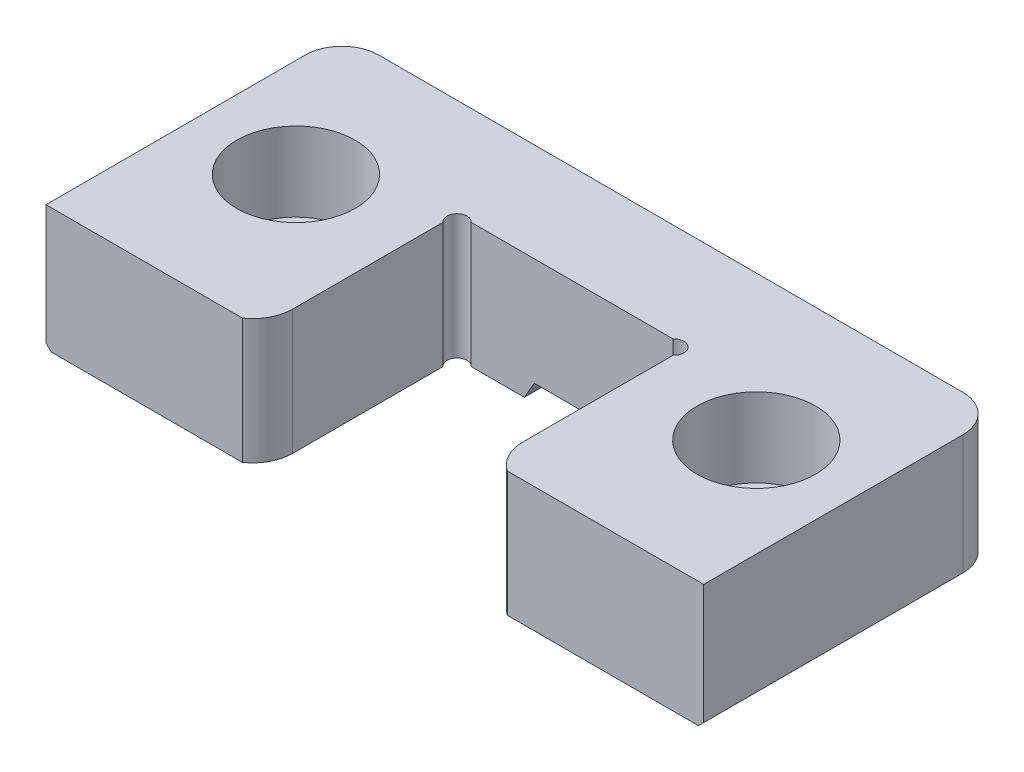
from build123d import *

# Parameters (mm, degrees)
BOSS_EXTRUDE1_DEPTH             = 19
FILLET1_R                       = 5.6
CUT_EXTRUDE1_DEPTH              = 70.899928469
SKETCH3_R                       = 1.52
CUT_EXTRUDE2_DEPTH              = 70.899928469
CUT_EXTRUDE3_DEPTH              = 70.899928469
CHAMFER5_SIZE                   = 3.8
CHAMFER5_SIZE2                  = 1.018206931
CBORE_FOR_M10_SHCS1_D           = 11
CBORE_FOR_M10_SHCS1_CBORE_D     = 18
CBORE_FOR_M10_SHCS1_CBORE_DEPTH = 12
CHAMFER6_SIZE                   = 0.8


with BuildPart() as part:
    # Sketch1 → Boss-Extrude1 (new body)
    with BuildSketch(Plane(origin=(0, 0, 0), x_dir=(1, 0, 0), z_dir=(0, 1, 0))):
        Polygon((17.499, 0), (50, 0), (50, 45), (-50, 45), (-50, 0), (-17.499, 0), (-17.499, 30), (17.499, 30), align=None)
    extrude(amount=-BOSS_EXTRUDE1_DEPTH)

    # Fillet1
    fillet1_edges = [part.edges().sort_by_distance(p)[0] for p in [
        (-50, -9.5, -45),
        (50, -9.5, -45),
    ]]
    fillet(fillet1_edges, radius=FILLET1_R)

    # Sketch2 → Cut-Extrude1 (cut, through all)
    with BuildSketch(Plane(origin=(0, 0, 0), x_dir=(1, 0, 0), z_dir=(0, 1, 0))):
        with BuildLine():
            Line((-17.499, 5), (-17.499, 12.7))
            Line((-17.499, 12.7), (17.499, 12.7))
            Line((17.499, 12.7), (17.499, 5))
            ThreePointArc((17.499, 5), (18.199896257, 2.172619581), (20.140272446, 0))
            Line((20.140272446, 0), (30.199, 0))
            Line((30.199, 0), (30.199, -25.4))
            Line((30.199, -25.4), (-30.199, -25.4))
            Line((-30.199, -25.4), (-30.199, 0))
            Line((-30.199, 0), (-20.140272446, 0))
            ThreePointArc((-20.140272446, 0), (-18.199896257, 2.172619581), (-17.499, 5))
        make_face()
    extrude(amount=-CUT_EXTRUDE1_DEPTH, mode=Mode.SUBTRACT)

    # Sketch3 → Cut-Extrude2 (cut, through all)
    with BuildSketch(Plane(origin=(0, 0, 0), x_dir=(1, 0, 0), z_dir=(0, 1, 0))):
        with Locations((-16.489, 28.99)):
            Circle(SKETCH3_R)
        with Locations((16.489, 28.99)):
            Circle(SKETCH3_R)
    extrude(amount=-CUT_EXTRUDE2_DEPTH, mode=Mode.SUBTRACT)

    # Sketch5 → Cut-Extrude3 (cut, through all)
    with BuildSketch(Plane(origin=(0, 0, -45), x_dir=(-1, 0, 0), z_dir=(0, 0, -1))):
        Polygon((-6.35, -17.41), (6.35, -17.41), (7.267986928, -19), (-7.267986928, -19), align=None)
    extrude(amount=-CUT_EXTRUDE3_DEPTH, mode=Mode.SUBTRACT)

    # Chamfer5
    chamfer5_edges = [part.edges().sort_by_distance(p)[0] for p in [
        (0, -17.41, -30),
    ]]
    chamfer5_side = [part.faces().sort_by_distance(p)[0] for p in [
        (0, -17.41, -37.5),
    ]]
    chamfer(chamfer5_edges, length=CHAMFER5_SIZE, length2=CHAMFER5_SIZE2, reference=chamfer5_side[0])

    # CBORE for M10 SHCS1 (through all)
    with Locations(Plane(origin=(0, 0, 0), x_dir=(-1, 0, 0), z_dir=(0, 1, 0))):
        with Locations((-35, -23), (35, -23)):
            CounterBoreHole(CBORE_FOR_M10_SHCS1_D / 2, CBORE_FOR_M10_SHCS1_CBORE_D / 2, CBORE_FOR_M10_SHCS1_CBORE_DEPTH)

    # Chamfer6
    chamfer6_edges = [part.edges().sort_by_distance(p)[0] for p in [
        (50, -19, -19.7),
        (25.833993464, -19, -45),
        (-50, -19, -19.7),
        (-48.359797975, -19, -43.359797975),
        (48.359797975, -19, -43.359797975),
        (-25.833993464, -19, -45),
    ]]
    chamfer(chamfer6_edges, length=CHAMFER6_SIZE)


solid = part.part
